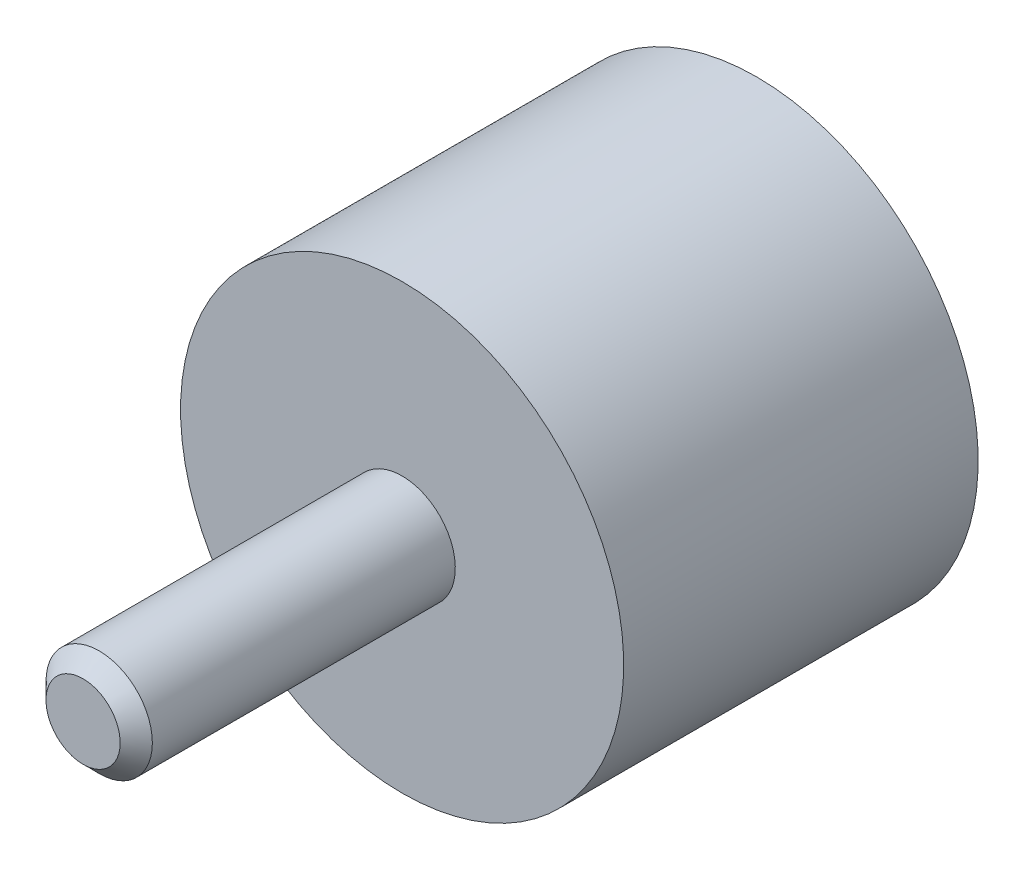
ISO-10303-21;
HEADER;
FILE_DESCRIPTION(('STEP AP214'),'2;1');
FILE_NAME('part.step','',(''),(''),'','','');
FILE_SCHEMA(('AUTOMOTIVE_DESIGN { 1 0 10303 214 1 1 1 1 }'));
ENDSEC;
DATA;
#1=APPLICATION_CONTEXT('core data for automotive mechanical design processes');
#2=APPLICATION_PROTOCOL_DEFINITION('international standard','automotive_design',2000,#1);
#3=PRODUCT_CONTEXT('',#1,'mechanical');
#4=PRODUCT('Part','Part','',(#3));
#5=PRODUCT_RELATED_PRODUCT_CATEGORY('part','',(#4));
#6=PRODUCT_DEFINITION_FORMATION('','',#4);
#7=PRODUCT_DEFINITION_CONTEXT('part definition',#1,'design');
#8=PRODUCT_DEFINITION('design','',#6,#7);
#9=PRODUCT_DEFINITION_SHAPE('','',#8);
#10=(LENGTH_UNIT() NAMED_UNIT(*) SI_UNIT(.MILLI.,.METRE.));
#11=(NAMED_UNIT(*) PLANE_ANGLE_UNIT() SI_UNIT($,.RADIAN.));
#12=(NAMED_UNIT(*) SI_UNIT($,.STERADIAN.) SOLID_ANGLE_UNIT());
#13=UNCERTAINTY_MEASURE_WITH_UNIT(LENGTH_MEASURE(1.E-05),#10,'distance_accuracy_value','');
#14=(GEOMETRIC_REPRESENTATION_CONTEXT(3) GLOBAL_UNCERTAINTY_ASSIGNED_CONTEXT((#13)) GLOBAL_UNIT_ASSIGNED_CONTEXT((#10,
#11,#12)) REPRESENTATION_CONTEXT('',''));
#15=CARTESIAN_POINT('',(0.,0.,0.));
#16=DIRECTION('',(0.,0.,1.));
#17=DIRECTION('',(1.,0.,0.));
#18=AXIS2_PLACEMENT_3D('',#15,#16,#17);
#19=CARTESIAN_POINT('',(0.,0.,0.));
#20=DIRECTION('',(0.,0.,1.));
#21=DIRECTION('',(0.,-1.,0.));
#22=AXIS2_PLACEMENT_3D('',#19,#20,#21);
#23=CYLINDRICAL_SURFACE('',#22,12.5);
#24=CARTESIAN_POINT('',(0.,0.,0.));
#25=DIRECTION('',(0.,0.,1.));
#26=DIRECTION('',(0.,-1.,0.));
#27=AXIS2_PLACEMENT_3D('',#24,#25,#26);
#28=CIRCLE('',#27,12.5);
#29=CARTESIAN_POINT('',(0.,-12.5,0.));
#30=VERTEX_POINT('',#29);
#31=EDGE_CURVE('E18',#30,#30,#28,.T.);
#32=ORIENTED_EDGE('',*,*,#31,.T.);
#33=EDGE_LOOP('',(#32));
#34=FACE_BOUND('',#33,.T.);
#35=CARTESIAN_POINT('',(0.,0.,20.));
#36=DIRECTION('',(0.,0.,-1.));
#37=DIRECTION('',(0.,1.,0.));
#38=AXIS2_PLACEMENT_3D('',#35,#36,#37);
#39=CIRCLE('',#38,12.5);
#40=CARTESIAN_POINT('',(0.,12.5,20.));
#41=VERTEX_POINT('',#40);
#42=EDGE_CURVE('E22',#41,#41,#39,.T.);
#43=ORIENTED_EDGE('',*,*,#42,.T.);
#44=EDGE_LOOP('',(#43));
#45=FACE_BOUND('',#44,.T.);
#46=ADVANCED_FACE('F12',(#34,#45),#23,.T.);
#47=CARTESIAN_POINT('',(12.5,0.,0.));
#48=DIRECTION('',(0.,0.,-1.));
#49=DIRECTION('',(0.,1.,0.));
#50=AXIS2_PLACEMENT_3D('',#47,#48,#49);
#51=PLANE('',#50);
#52=ORIENTED_EDGE('',*,*,#31,.F.);
#53=EDGE_LOOP('',(#52));
#54=FACE_BOUND('',#53,.T.);
#55=ADVANCED_FACE('F48',(#54),#51,.T.);
#56=CARTESIAN_POINT('',(12.5,0.,20.));
#57=DIRECTION('',(0.,0.,1.));
#58=DIRECTION('',(0.,-1.,0.));
#59=AXIS2_PLACEMENT_3D('',#56,#57,#58);
#60=PLANE('',#59);
#61=CARTESIAN_POINT('',(0.,0.,20.));
#62=DIRECTION('',(0.,0.,1.));
#63=DIRECTION('',(0.,-1.,0.));
#64=AXIS2_PLACEMENT_3D('',#61,#62,#63);
#65=CIRCLE('',#64,3.);
#66=CARTESIAN_POINT('',(0.,-3.,20.));
#67=VERTEX_POINT('',#66);
#68=EDGE_CURVE('E8',#67,#67,#65,.F.);
#69=ORIENTED_EDGE('',*,*,#68,.T.);
#70=EDGE_LOOP('',(#69));
#71=FACE_BOUND('',#70,.T.);
#72=ORIENTED_EDGE('',*,*,#42,.F.);
#73=EDGE_LOOP('',(#72));
#74=FACE_BOUND('',#73,.T.);
#75=ADVANCED_FACE('F52',(#71,#74),#60,.T.);
#76=CARTESIAN_POINT('',(0.,0.,15.));
#77=DIRECTION('',(0.,0.,1.));
#78=DIRECTION('',(0.,-1.,0.));
#79=AXIS2_PLACEMENT_3D('',#76,#77,#78);
#80=CYLINDRICAL_SURFACE('',#79,3.);
#81=ORIENTED_EDGE('',*,*,#68,.F.);
#82=EDGE_LOOP('',(#81));
#83=FACE_BOUND('',#82,.T.);
#84=CARTESIAN_POINT('',(0.,0.,37.0920477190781));
#85=DIRECTION('',(0.,0.,-1.));
#86=DIRECTION('',(0.,1.,0.));
#87=AXIS2_PLACEMENT_3D('',#84,#85,#86);
#88=CIRCLE('',#87,3.);
#89=CARTESIAN_POINT('',(0.,3.,37.0920477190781));
#90=VERTEX_POINT('',#89);
#91=EDGE_CURVE('E26',#90,#90,#88,.T.);
#92=ORIENTED_EDGE('',*,*,#91,.T.);
#93=EDGE_LOOP('',(#92));
#94=FACE_BOUND('',#93,.T.);
#95=ADVANCED_FACE('F45',(#83,#94),#80,.T.);
#96=CARTESIAN_POINT('',(0.,0.,37.0920477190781));
#97=DIRECTION('',(0.,0.,-1.));
#98=DIRECTION('',(0.,1.,0.));
#99=AXIS2_PLACEMENT_3D('',#96,#97,#98);
#100=CONICAL_SURFACE('',#99,3.,0.785398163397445);
#101=CARTESIAN_POINT('',(0.,0.,38.));
#102=DIRECTION('',(0.,0.,-1.));
#103=DIRECTION('',(0.,1.,0.));
#104=AXIS2_PLACEMENT_3D('',#101,#102,#103);
#105=CIRCLE('',#104,2.09204771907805);
#106=CARTESIAN_POINT('',(0.,2.09204771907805,38.));
#107=VERTEX_POINT('',#106);
#108=EDGE_CURVE('E31',#107,#107,#105,.T.);
#109=ORIENTED_EDGE('',*,*,#108,.T.);
#110=EDGE_LOOP('',(#109));
#111=FACE_BOUND('',#110,.T.);
#112=ORIENTED_EDGE('',*,*,#91,.F.);
#113=EDGE_LOOP('',(#112));
#114=FACE_BOUND('',#113,.T.);
#115=ADVANCED_FACE('F35',(#111,#114),#100,.T.);
#116=CARTESIAN_POINT('',(2.09204771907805,0.,38.));
#117=DIRECTION('',(0.,0.,1.));
#118=DIRECTION('',(0.,-1.,0.));
#119=AXIS2_PLACEMENT_3D('',#116,#117,#118);
#120=PLANE('',#119);
#121=ORIENTED_EDGE('',*,*,#108,.F.);
#122=EDGE_LOOP('',(#121));
#123=FACE_BOUND('',#122,.T.);
#124=ADVANCED_FACE('F38',(#123),#120,.T.);
#125=CLOSED_SHELL('',(#46,#55,#75,#95,#115,#124));
#126=MANIFOLD_SOLID_BREP('B1',#125);
#127=ADVANCED_BREP_SHAPE_REPRESENTATION('',(#18,#126),#14);
#128=SHAPE_DEFINITION_REPRESENTATION(#9,#127);
ENDSEC;
END-ISO-10303-21;
